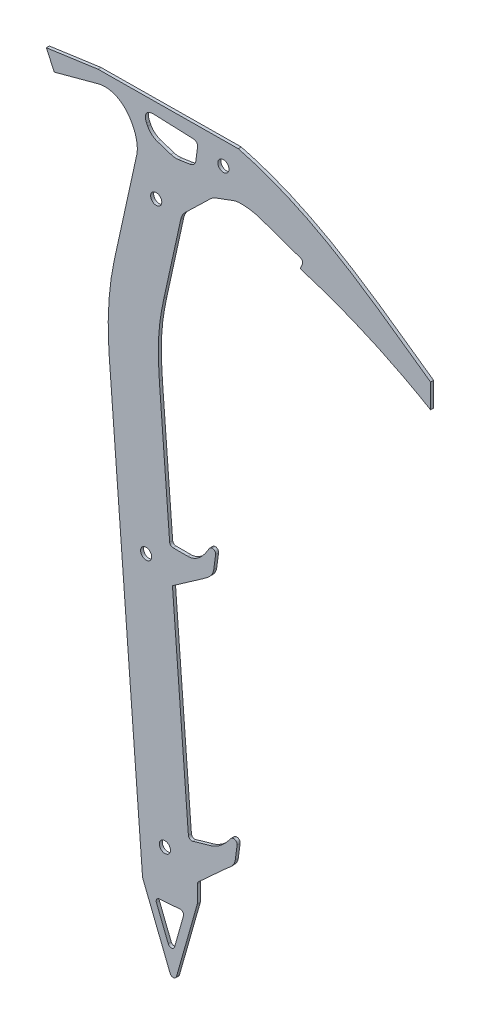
from build123d import *

# Parameters (mm, degrees)
BOSS_EXTRUDE1_DEPTH      = 1.143
FILLET1_R                = 2.54
CUT_EXTRUDE1_DEPTH       = 460.961915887
CUT_EXTRUDE1_DEPTH_BACK  = 460.961915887
BOSS_EXTRUDE4_DEPTH      = 2.286
FILLET2_R                = 12.7
F_5_16_CLEARANCE_HOLE1_D = 8.4328


with BuildPart() as part:
    # Sketch2 → Boss-Extrude1 (new, symmetric)
    with BuildSketch(Plane.XY):
        with BuildLine():
            Line((-24.381519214, 54.99437995), (6.683618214, -350.216574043))
            Line((6.683618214, -350.216574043), (30.344648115, -409.633291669))
            Line((30.344648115, -409.633291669), (48.164661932, -347.036466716))
            Line((48.164661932, -347.036466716), (48.164661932, -332.698935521))
            Line((48.164661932, -332.698935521), (69.074652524, -313.547154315))
            add(Edge.make_bspline(
                [(76.966360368, -303.659842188), (76.35046024, -308.232220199), (72.184299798, -310.698980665), (69.074652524, -313.547154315)],
                knots=[0, 0, 0, 0, 1, 1, 1, 1], degree=3))
            Line((76.966360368, -303.659842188), (78.782448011, -290.177397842))
            Line((78.782448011, -290.177397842), (74.335791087, -290.177397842))
            add(Edge.make_bspline(
                [(74.335791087, -290.177397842), (66.934957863, -301.027986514), (58.01686648, -303.581901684)],
                knots=[0, 0, 0, 1, 1, 1], degree=2))
            Line((58.01686648, -303.581901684), (41.678906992, -308.26067888))
            Line((41.678906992, -308.26067888), (29.333329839, -147.226042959))
            Line((29.333329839, -147.226042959), (52.755727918, -130.901673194))
            add(Edge.make_bspline(
                [(60.647435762, -121.014361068), (60.031535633, -125.586739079), (56.215263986, -128.490530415), (52.755727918, -130.901673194)],
                knots=[0, 0, 0, 0, 1, 1, 1, 1], degree=3))
            Line((60.647435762, -121.014361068), (62.463523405, -107.531916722))
            Line((62.463523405, -107.531916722), (58.01686648, -107.531916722))
            add(Edge.make_bspline(
                [(58.01686648, -107.531916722), (50.196524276, -122.077096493), (40.919949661, -122.077096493)],
                knots=[0, 0, 0, 1, 1, 1], degree=2))
            Line((40.919949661, -122.077096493), (27.405308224, -122.077096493))
            Line((27.405308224, -122.077096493), (13.607007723, 57.906736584))
            add(Edge.make_bspline(
                [(17.032953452, 114.24896132), (11.964804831, 91.155831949), (12.168759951, 76.667115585), (13.607007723, 57.906736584)],
                knots=[0, 0, 0, 0, 1, 1, 1, 1], degree=3))
            Line((17.032953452, 114.24896132), (33.367484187, 188.677605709))
            add(Edge.make_bspline(
                [(33.367484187, 188.677605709), (33.899739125, 191.102836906), (36.146756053, 192.340586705), (38.192170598, 193.098192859)],
                knots=[0, 0, 0, 0, 1, 1, 1, 1], degree=3))
            Line((38.192170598, 193.098192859), (70.085762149, 204.911339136))
            add(Edge.make_bspline(
                [(70.085762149, 204.911339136), (74.268627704, 206.460641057), (83.723559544, 205.582408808), (90.006443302, 203.373136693)],
                knots=[0, 0, 0, 0, 1, 1, 1, 1], degree=3))
            Line((90.006443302, 203.373136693), (123.180174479, 191.708143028))
            Line((123.180174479, 191.708143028), (120.443490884, 185.463663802))
            add(Edge.make_bspline(
                [(219.315189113, 142.132499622), (171.677494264, 170.127728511), (120.443490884, 185.463663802)],
                knots=[0, 0, 0, 1, 1, 1], degree=2))
            Line((219.315189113, 142.132499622), (219.315189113, 160.422302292))
            add(Edge.make_bspline(
                [(219.315189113, 160.422302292), (171.735920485, 194.082892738), (130.178449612, 225.964616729), (73.415353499, 240.7485989)],
                knots=[0, 0, 0, 0, 1, 1, 1, 1], degree=3))
            Line((73.415353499, 240.7485989), (-33.000104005, 239.774233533))
            Line((-33.000104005, 239.774233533), (-72.087681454, 234.290783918))
            Line((-72.087681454, 234.290783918), (-66.119763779, 221.276409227))
            Line((-66.119763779, 221.276409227), (-33.000104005, 230.193837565))
            add(Edge.make_bspline(
                [(-33.000104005, 230.193837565), (-27.13666736, 231.772560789), (-14.986765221, 229.420511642), (-4.288211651, 214.563912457), (-2.529081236, 202.849258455), (-3.595864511, 197.988437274)],
                knots=[0, 0, 0, 0, 0.318927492, 0.707775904, 1, 1, 1, 1], degree=3))
            Line((-3.595864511, 197.988437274), (-20.611000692, 120.458599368))
            add(Edge.make_bspline(
                [(-24.381519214, 54.99437995), (-26.15460413, 78.122345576), (-25.103627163, 99.987849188), (-20.611000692, 120.458599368)],
                knots=[0, 0, 0, 0, 1, 1, 1, 1], degree=3))
        make_face()
        with BuildLine():
            Line((9.964083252, 231.351414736), (39.214695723, 230.193837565))
            add(Edge.make_bspline(
                [(39.214695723, 230.193837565), (41.861982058, 230.089072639), (42.833111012, 228.148273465), (42.601608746, 226.476312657)],
                knots=[0, 0, 0, 0, 1, 1, 1, 1], degree=3))
            Line((42.601608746, 226.476312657), (41.216053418, 216.46952418))
            add(Edge.make_bspline(
                [(36.546218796, 212.210224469), (39.435581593, 212.651197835), (40.927093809, 214.382593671), (41.216053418, 216.46952418)],
                knots=[0, 0, 0, 0, 1, 1, 1, 1], degree=3))
            Line((36.546218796, 212.210224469), (14.018115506, 208.771994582))
            add(Edge.make_bspline(
                [(10.323301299, 210.106233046), (10.912672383, 208.936920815), (12.145186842, 208.486148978), (14.018115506, 208.771994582)],
                knots=[0, 0, 0, 0, 1, 1, 1, 1], degree=3))
            Line((10.323301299, 210.106233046), (3.908693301, 222.832815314))
            add(Edge.make_bspline(
                [(3.908693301, 222.832815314), (2.340645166, 225.943822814), (1.853713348, 231.672378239), (9.964083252, 231.351414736)],
                knots=[0, 0, 0, 0, 1, 1, 1, 1], degree=3))
        make_face(mode=Mode.SUBTRACT)
        Polygon((15.906915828, -358.22479), (38.696088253, -356.477678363), (28.905993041, -390.867599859), align=None, mode=Mode.SUBTRACT)
    extrude(amount=BOSS_EXTRUDE1_DEPTH, both=True)

    # Fillet1
    fillet1_edges = [part.edges().sort_by_distance(p)[0] for p in [
        (123.180174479, 191.708143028, 0),
        (-33.000104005, 239.774233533, 0),
        (6.683618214, -350.216574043, 0),
        (30.344648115, -409.633291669, 0),
        (48.164661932, -347.036466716, 0),
        (48.164661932, -332.698935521, 0),
        (41.678906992, -308.26067888, 0),
        (74.335791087, -290.177397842, 0.5715),
        (78.782448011, -290.177397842, 0),
        (27.405308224, -122.077096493, 0),
        (58.01686648, -107.531916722, 0.5715),
        (62.463523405, -107.531916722, 0),
        (28.905993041, -390.867599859, 0),
        (15.906915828, -358.22479, 0),
        (38.696088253, -356.477678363, 0),
    ]]
    fillet(fillet1_edges, radius=FILLET1_R)

    # Sketch6 → Cut-Extrude1 (cut, two sides: drawn at the far end of the back side and taken through both)
    with BuildSketch(Plane.XY.offset(1.143).offset(-CUT_EXTRUDE1_DEPTH_BACK)):
        Polygon((-21.77570053, 21.004307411), (16.212826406, 23.916664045), (22.037539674, -52.060389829), (-15.950987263, -54.972746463), align=None)
    extrude(amount=CUT_EXTRUDE1_DEPTH + CUT_EXTRUDE1_DEPTH_BACK, mode=Mode.SUBTRACT)


with BuildPart() as cut_extrude1_piece_1:
    # of the separate pieces the step leaves, piece 1, a body of its own (cut_extrude1_pieces)
    add(part.part.solids().sort_by_distance((-24.381519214, 54.99437995, 0))[0])


with BuildPart() as cut_extrude1_piece_2:
    # of the separate pieces the step leaves, piece 2, a body of its own (cut_extrude1_pieces)
    add(part.part.solids().sort_by_distance((-15.950987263, -54.972746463, -1.143))[0])


with BuildPart() as cut_extrude1_piece_1_1:
    # Body-Move_Copy1: moved
    add(cut_extrude1_piece_1.part.moved(Location((5.824713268, -75.977053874, 0))))

    # Combine1: union Cut-Extrude1 piece 2
    add(cut_extrude1_piece_2.part)

    # Sketch8 → Boss-Extrude4 (add)
    with BuildSketch(Plane.XY.offset(1.143)):
        with BuildLine():
            Line((59.963679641, 123.027712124), (36.469775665, 100.295777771))
            Line((36.469775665, 100.295777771), (39.192197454, 112.700551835))
            add(Edge.make_bspline(
                [(39.192197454, 112.700551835), (39.724452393, 115.125783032), (41.97146932, 116.363532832), (44.016883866, 117.121138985)],
                knots=[0, 0, 0, 0, 1, 1, 1, 1], degree=3))
            Line((44.016883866, 117.121138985), (59.963679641, 123.027712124))
        make_face()
        with BuildLine():
            Line((12.940710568, 140.492470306), (16.148014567, 134.129179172))
            add(Edge.make_bspline(
                [(16.148014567, 134.129179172), (16.737385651, 132.959866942), (17.96990011, 132.509095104), (19.842828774, 132.794940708)],
                knots=[0, 0, 0, 0, 1, 1, 1, 1], degree=3))
            Line((19.842828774, 132.794940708), (31.106880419, 134.514055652))
            Line((31.106880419, 134.514055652), (12.940710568, 140.492470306))
        make_face()
    extrude(amount=-BOSS_EXTRUDE4_DEPTH)

    # Fillet2
    fillet2_edges = [cut_extrude1_piece_1_1.edges().sort_by_distance(p)[0] for p in [
        (59.963679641, 123.027712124, 0),
        (36.469775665, 100.295777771, 0),
        (12.940710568, 140.492470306, 0),
        (31.106880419, 134.514055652, 0),
    ]]
    fillet(fillet2_edges, radius=FILLET2_R)

    # 5_16 Clearance Hole1 (through all)
    with Locations(Plane(origin=(0, 0, -1.143), x_dir=(-1, 0, 0), z_dir=(0, 0, -1))):
        with Locations((-68.009242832, 147.741681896), (-17.04154454, 100.638187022), (-9.381929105, -136.197405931), (-23.611541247, -321.807230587)):
            Hole(F_5_16_CLEARANCE_HOLE1_D / 2)


solid = cut_extrude1_piece_1_1.part
